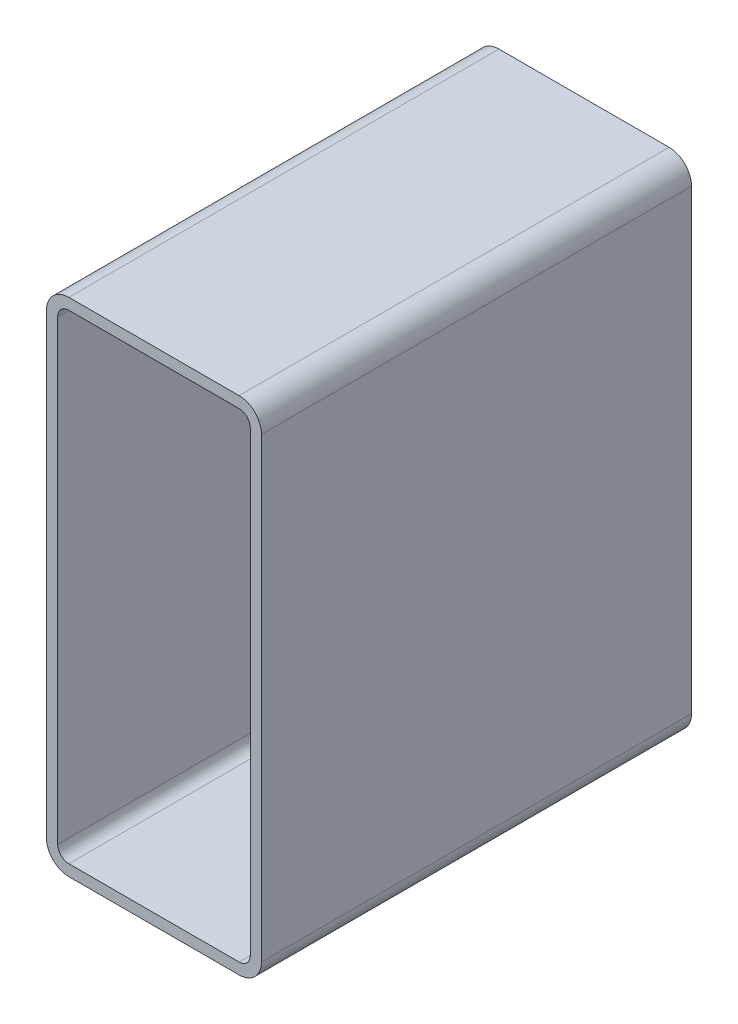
ISO-10303-21;
HEADER;
FILE_DESCRIPTION(('STEP AP214'),'2;1');
FILE_NAME('part.step','',(''),(''),'','','');
FILE_SCHEMA(('AUTOMOTIVE_DESIGN { 1 0 10303 214 1 1 1 1 }'));
ENDSEC;
DATA;
#1=APPLICATION_CONTEXT('core data for automotive mechanical design processes');
#2=APPLICATION_PROTOCOL_DEFINITION('international standard','automotive_design',2000,#1);
#3=PRODUCT_CONTEXT('',#1,'mechanical');
#4=PRODUCT('Part','Part','',(#3));
#5=PRODUCT_RELATED_PRODUCT_CATEGORY('part','',(#4));
#6=PRODUCT_DEFINITION_FORMATION('','',#4);
#7=PRODUCT_DEFINITION_CONTEXT('part definition',#1,'design');
#8=PRODUCT_DEFINITION('design','',#6,#7);
#9=PRODUCT_DEFINITION_SHAPE('','',#8);
#10=(LENGTH_UNIT() NAMED_UNIT(*) SI_UNIT(.MILLI.,.METRE.));
#11=(NAMED_UNIT(*) PLANE_ANGLE_UNIT() SI_UNIT($,.RADIAN.));
#12=(NAMED_UNIT(*) SI_UNIT($,.STERADIAN.) SOLID_ANGLE_UNIT());
#13=UNCERTAINTY_MEASURE_WITH_UNIT(LENGTH_MEASURE(1.E-05),#10,'distance_accuracy_value','');
#14=(GEOMETRIC_REPRESENTATION_CONTEXT(3) GLOBAL_UNCERTAINTY_ASSIGNED_CONTEXT((#13)) GLOBAL_UNIT_ASSIGNED_CONTEXT((#10,
#11,#12)) REPRESENTATION_CONTEXT('',''));
#15=CARTESIAN_POINT('',(0.,0.,0.));
#16=DIRECTION('',(0.,0.,1.));
#17=DIRECTION('',(1.,0.,0.));
#18=AXIS2_PLACEMENT_3D('',#15,#16,#17);
#19=CARTESIAN_POINT('',(15.9223013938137,341.553679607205,304.8));
#20=DIRECTION('',(0.,0.,1.));
#21=DIRECTION('',(1.,0.,0.));
#22=AXIS2_PLACEMENT_3D('',#19,#20,#21);
#23=PLANE('',#22);
#24=CARTESIAN_POINT('',(15.9223013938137,341.553679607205,304.8));
#25=DIRECTION('',(0.,0.,1.));
#26=DIRECTION('',(1.,0.,0.));
#27=AXIS2_PLACEMENT_3D('',#24,#25,#26);
#28=CIRCLE('',#27,15.875);
#29=CARTESIAN_POINT('',(15.9223013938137,357.428679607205,304.8));
#30=VERTEX_POINT('',#29);
#31=CARTESIAN_POINT('',(0.0473013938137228,341.553679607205,304.8));
#32=VERTEX_POINT('',#31);
#33=EDGE_CURVE('E211',#30,#32,#28,.T.);
#34=ORIENTED_EDGE('',*,*,#33,.T.);
#35=DIRECTION('',(0.,-1.,0.));
#36=VECTOR('',#35,1.);
#37=CARTESIAN_POINT('',(0.0473013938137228,17.7036796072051,304.8));
#38=LINE('',#37,#36);
#39=CARTESIAN_POINT('',(0.0473013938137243,17.7036796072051,304.8));
#40=VERTEX_POINT('',#39);
#41=EDGE_CURVE('E214',#32,#40,#38,.T.);
#42=ORIENTED_EDGE('',*,*,#41,.T.);
#43=CARTESIAN_POINT('',(15.9223013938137,17.7036796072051,304.8));
#44=DIRECTION('',(0.,0.,1.));
#45=DIRECTION('',(1.,0.,0.));
#46=AXIS2_PLACEMENT_3D('',#43,#44,#45);
#47=CIRCLE('',#46,15.875);
#48=CARTESIAN_POINT('',(15.9223013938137,1.82867960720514,304.8));
#49=VERTEX_POINT('',#48);
#50=EDGE_CURVE('E217',#40,#49,#47,.T.);
#51=ORIENTED_EDGE('',*,*,#50,.T.);
#52=DIRECTION('',(1.,0.,0.));
#53=VECTOR('',#52,1.);
#54=CARTESIAN_POINT('',(136.572301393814,1.82867960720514,304.8));
#55=LINE('',#54,#53);
#56=CARTESIAN_POINT('',(136.572301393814,1.82867960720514,304.8));
#57=VERTEX_POINT('',#56);
#58=EDGE_CURVE('E219',#49,#57,#55,.T.);
#59=ORIENTED_EDGE('',*,*,#58,.T.);
#60=CARTESIAN_POINT('',(136.572301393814,17.7036796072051,304.8));
#61=DIRECTION('',(0.,0.,1.));
#62=DIRECTION('',(1.,0.,0.));
#63=AXIS2_PLACEMENT_3D('',#60,#61,#62);
#64=CIRCLE('',#63,15.875);
#65=CARTESIAN_POINT('',(152.447301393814,17.7036796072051,304.8));
#66=VERTEX_POINT('',#65);
#67=EDGE_CURVE('E221',#57,#66,#64,.T.);
#68=ORIENTED_EDGE('',*,*,#67,.T.);
#69=DIRECTION('',(0.,1.,0.));
#70=VECTOR('',#69,1.);
#71=CARTESIAN_POINT('',(152.447301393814,341.553679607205,304.8));
#72=LINE('',#71,#70);
#73=CARTESIAN_POINT('',(152.447301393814,341.553679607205,304.8));
#74=VERTEX_POINT('',#73);
#75=EDGE_CURVE('E223',#66,#74,#72,.T.);
#76=ORIENTED_EDGE('',*,*,#75,.T.);
#77=CARTESIAN_POINT('',(136.572301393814,341.553679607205,304.8));
#78=DIRECTION('',(0.,0.,1.));
#79=DIRECTION('',(1.,0.,0.));
#80=AXIS2_PLACEMENT_3D('',#77,#78,#79);
#81=CIRCLE('',#80,15.8749999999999);
#82=CARTESIAN_POINT('',(136.572301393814,357.428679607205,304.8));
#83=VERTEX_POINT('',#82);
#84=EDGE_CURVE('E225',#74,#83,#81,.T.);
#85=ORIENTED_EDGE('',*,*,#84,.T.);
#86=DIRECTION('',(-1.,0.,0.));
#87=VECTOR('',#86,1.);
#88=CARTESIAN_POINT('',(15.9223013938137,357.428679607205,304.8));
#89=LINE('',#88,#87);
#90=EDGE_CURVE('E227',#83,#30,#89,.T.);
#91=ORIENTED_EDGE('',*,*,#90,.T.);
#92=EDGE_LOOP('',(#34,#42,#51,#59,#68,#76,#85,#91));
#93=FACE_BOUND('',#92,.T.);
#94=DIRECTION('',(0.,-1.,0.));
#95=VECTOR('',#94,1.);
#96=CARTESIAN_POINT('',(7.98480139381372,17.7036796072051,304.8));
#97=LINE('',#96,#95);
#98=CARTESIAN_POINT('',(7.98480139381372,341.553679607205,304.8));
#99=VERTEX_POINT('',#98);
#100=CARTESIAN_POINT('',(7.98480139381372,17.7036796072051,304.8));
#101=VERTEX_POINT('',#100);
#102=EDGE_CURVE('E154',#99,#101,#97,.T.);
#103=ORIENTED_EDGE('',*,*,#102,.F.);
#104=CARTESIAN_POINT('',(15.9223013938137,341.553679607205,304.8));
#105=DIRECTION('',(0.,0.,1.));
#106=DIRECTION('',(1.,0.,0.));
#107=AXIS2_PLACEMENT_3D('',#104,#105,#106);
#108=CIRCLE('',#107,7.93749999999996);
#109=CARTESIAN_POINT('',(15.9223013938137,349.491179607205,304.8));
#110=VERTEX_POINT('',#109);
#111=EDGE_CURVE('E146',#110,#99,#108,.T.);
#112=ORIENTED_EDGE('',*,*,#111,.F.);
#113=DIRECTION('',(-1.,0.,0.));
#114=VECTOR('',#113,1.);
#115=CARTESIAN_POINT('',(15.9223013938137,349.491179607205,304.8));
#116=LINE('',#115,#114);
#117=CARTESIAN_POINT('',(136.572301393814,349.491179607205,304.8));
#118=VERTEX_POINT('',#117);
#119=EDGE_CURVE('E179',#118,#110,#116,.T.);
#120=ORIENTED_EDGE('',*,*,#119,.F.);
#121=CARTESIAN_POINT('',(136.572301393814,341.553679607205,304.8));
#122=DIRECTION('',(0.,0.,1.));
#123=DIRECTION('',(1.,0.,0.));
#124=AXIS2_PLACEMENT_3D('',#121,#122,#123);
#125=CIRCLE('',#124,7.93749999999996);
#126=CARTESIAN_POINT('',(144.509801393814,341.553679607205,304.8));
#127=VERTEX_POINT('',#126);
#128=EDGE_CURVE('E177',#127,#118,#125,.T.);
#129=ORIENTED_EDGE('',*,*,#128,.F.);
#130=DIRECTION('',(0.,1.,0.));
#131=VECTOR('',#130,1.);
#132=CARTESIAN_POINT('',(144.509801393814,341.553679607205,304.8));
#133=LINE('',#132,#131);
#134=CARTESIAN_POINT('',(144.509801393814,17.7036796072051,304.8));
#135=VERTEX_POINT('',#134);
#136=EDGE_CURVE('E175',#135,#127,#133,.T.);
#137=ORIENTED_EDGE('',*,*,#136,.F.);
#138=CARTESIAN_POINT('',(136.572301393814,17.7036796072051,304.8));
#139=DIRECTION('',(0.,0.,1.));
#140=DIRECTION('',(1.,0.,0.));
#141=AXIS2_PLACEMENT_3D('',#138,#139,#140);
#142=CIRCLE('',#141,7.93750000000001);
#143=CARTESIAN_POINT('',(136.572301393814,9.76617960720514,304.8));
#144=VERTEX_POINT('',#143);
#145=EDGE_CURVE('E173',#144,#135,#142,.T.);
#146=ORIENTED_EDGE('',*,*,#145,.F.);
#147=DIRECTION('',(1.,0.,0.));
#148=VECTOR('',#147,1.);
#149=CARTESIAN_POINT('',(136.572301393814,9.76617960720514,304.8));
#150=LINE('',#149,#148);
#151=CARTESIAN_POINT('',(15.9223013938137,9.76617960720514,304.8));
#152=VERTEX_POINT('',#151);
#153=EDGE_CURVE('E169',#152,#144,#150,.T.);
#154=ORIENTED_EDGE('',*,*,#153,.F.);
#155=CARTESIAN_POINT('',(15.9223013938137,17.7036796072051,304.8));
#156=DIRECTION('',(0.,0.,1.));
#157=DIRECTION('',(1.,0.,0.));
#158=AXIS2_PLACEMENT_3D('',#155,#156,#157);
#159=CIRCLE('',#158,7.9375);
#160=EDGE_CURVE('E167',#101,#152,#159,.T.);
#161=ORIENTED_EDGE('',*,*,#160,.F.);
#162=EDGE_LOOP('',(#103,#112,#120,#129,#137,#146,#154,#161));
#163=FACE_BOUND('',#162,.T.);
#164=ADVANCED_FACE('F33',(#93,#163),#23,.T.);
#165=CARTESIAN_POINT('',(15.9223013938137,341.553679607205,0.));
#166=DIRECTION('',(0.,0.,1.));
#167=DIRECTION('',(1.,0.,0.));
#168=AXIS2_PLACEMENT_3D('',#165,#166,#167);
#169=PLANE('',#168);
#170=CARTESIAN_POINT('',(15.9223013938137,341.553679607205,0.));
#171=DIRECTION('',(0.,0.,1.));
#172=DIRECTION('',(1.,0.,0.));
#173=AXIS2_PLACEMENT_3D('',#170,#171,#172);
#174=CIRCLE('',#173,15.875);
#175=CARTESIAN_POINT('',(15.9223013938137,357.428679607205,0.));
#176=VERTEX_POINT('',#175);
#177=CARTESIAN_POINT('',(0.0473013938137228,341.553679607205,0.));
#178=VERTEX_POINT('',#177);
#179=EDGE_CURVE('E162',#176,#178,#174,.T.);
#180=ORIENTED_EDGE('',*,*,#179,.F.);
#181=DIRECTION('',(-1.,0.,0.));
#182=VECTOR('',#181,1.);
#183=CARTESIAN_POINT('',(15.9223013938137,357.428679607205,0.));
#184=LINE('',#183,#182);
#185=CARTESIAN_POINT('',(136.572301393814,357.428679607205,0.));
#186=VERTEX_POINT('',#185);
#187=EDGE_CURVE('E215',#186,#176,#184,.T.);
#188=ORIENTED_EDGE('',*,*,#187,.F.);
#189=CARTESIAN_POINT('',(136.572301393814,341.553679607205,0.));
#190=DIRECTION('',(0.,0.,1.));
#191=DIRECTION('',(1.,0.,0.));
#192=AXIS2_PLACEMENT_3D('',#189,#190,#191);
#193=CIRCLE('',#192,15.8749999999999);
#194=CARTESIAN_POINT('',(152.447301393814,341.553679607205,0.));
#195=VERTEX_POINT('',#194);
#196=EDGE_CURVE('E242',#195,#186,#193,.T.);
#197=ORIENTED_EDGE('',*,*,#196,.F.);
#198=DIRECTION('',(0.,1.,0.));
#199=VECTOR('',#198,1.);
#200=CARTESIAN_POINT('',(152.447301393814,341.553679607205,0.));
#201=LINE('',#200,#199);
#202=CARTESIAN_POINT('',(152.447301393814,17.7036796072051,0.));
#203=VERTEX_POINT('',#202);
#204=EDGE_CURVE('E240',#203,#195,#201,.T.);
#205=ORIENTED_EDGE('',*,*,#204,.F.);
#206=CARTESIAN_POINT('',(136.572301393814,17.7036796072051,0.));
#207=DIRECTION('',(0.,0.,1.));
#208=DIRECTION('',(1.,0.,0.));
#209=AXIS2_PLACEMENT_3D('',#206,#207,#208);
#210=CIRCLE('',#209,15.875);
#211=CARTESIAN_POINT('',(136.572301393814,1.82867960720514,0.));
#212=VERTEX_POINT('',#211);
#213=EDGE_CURVE('E238',#212,#203,#210,.T.);
#214=ORIENTED_EDGE('',*,*,#213,.F.);
#215=DIRECTION('',(1.,0.,0.));
#216=VECTOR('',#215,1.);
#217=CARTESIAN_POINT('',(136.572301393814,1.82867960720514,0.));
#218=LINE('',#217,#216);
#219=CARTESIAN_POINT('',(15.9223013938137,1.82867960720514,0.));
#220=VERTEX_POINT('',#219);
#221=EDGE_CURVE('E236',#220,#212,#218,.T.);
#222=ORIENTED_EDGE('',*,*,#221,.F.);
#223=CARTESIAN_POINT('',(15.9223013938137,17.7036796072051,0.));
#224=DIRECTION('',(0.,0.,1.));
#225=DIRECTION('',(1.,0.,0.));
#226=AXIS2_PLACEMENT_3D('',#223,#224,#225);
#227=CIRCLE('',#226,15.875);
#228=CARTESIAN_POINT('',(0.0473013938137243,17.7036796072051,0.));
#229=VERTEX_POINT('',#228);
#230=EDGE_CURVE('E234',#229,#220,#227,.T.);
#231=ORIENTED_EDGE('',*,*,#230,.F.);
#232=DIRECTION('',(0.,-1.,0.));
#233=VECTOR('',#232,1.);
#234=CARTESIAN_POINT('',(0.0473013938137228,17.7036796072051,0.));
#235=LINE('',#234,#233);
#236=EDGE_CURVE('E232',#178,#229,#235,.T.);
#237=ORIENTED_EDGE('',*,*,#236,.F.);
#238=EDGE_LOOP('',(#180,#188,#197,#205,#214,#222,#231,#237));
#239=FACE_BOUND('',#238,.T.);
#240=CARTESIAN_POINT('',(15.9223013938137,341.553679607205,0.));
#241=DIRECTION('',(0.,0.,1.));
#242=DIRECTION('',(1.,0.,0.));
#243=AXIS2_PLACEMENT_3D('',#240,#241,#242);
#244=CIRCLE('',#243,7.93749999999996);
#245=CARTESIAN_POINT('',(15.9223013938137,349.491179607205,0.));
#246=VERTEX_POINT('',#245);
#247=CARTESIAN_POINT('',(7.98480139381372,341.553679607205,0.));
#248=VERTEX_POINT('',#247);
#249=EDGE_CURVE('E56',#246,#248,#244,.T.);
#250=ORIENTED_EDGE('',*,*,#249,.T.);
#251=DIRECTION('',(0.,-1.,0.));
#252=VECTOR('',#251,1.);
#253=CARTESIAN_POINT('',(7.98480139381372,17.7036796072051,0.));
#254=LINE('',#253,#252);
#255=CARTESIAN_POINT('',(7.98480139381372,17.7036796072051,0.));
#256=VERTEX_POINT('',#255);
#257=EDGE_CURVE('E161',#248,#256,#254,.T.);
#258=ORIENTED_EDGE('',*,*,#257,.T.);
#259=CARTESIAN_POINT('',(15.9223013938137,17.7036796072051,0.));
#260=DIRECTION('',(0.,0.,1.));
#261=DIRECTION('',(1.,0.,0.));
#262=AXIS2_PLACEMENT_3D('',#259,#260,#261);
#263=CIRCLE('',#262,7.9375);
#264=CARTESIAN_POINT('',(15.9223013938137,9.76617960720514,0.));
#265=VERTEX_POINT('',#264);
#266=EDGE_CURVE('E183',#256,#265,#263,.T.);
#267=ORIENTED_EDGE('',*,*,#266,.T.);
#268=DIRECTION('',(1.,0.,0.));
#269=VECTOR('',#268,1.);
#270=CARTESIAN_POINT('',(136.572301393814,9.76617960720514,0.));
#271=LINE('',#270,#269);
#272=CARTESIAN_POINT('',(136.572301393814,9.76617960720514,0.));
#273=VERTEX_POINT('',#272);
#274=EDGE_CURVE('E186',#265,#273,#271,.T.);
#275=ORIENTED_EDGE('',*,*,#274,.T.);
#276=CARTESIAN_POINT('',(136.572301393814,17.7036796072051,0.));
#277=DIRECTION('',(0.,0.,1.));
#278=DIRECTION('',(1.,0.,0.));
#279=AXIS2_PLACEMENT_3D('',#276,#277,#278);
#280=CIRCLE('',#279,7.93750000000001);
#281=CARTESIAN_POINT('',(144.509801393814,17.7036796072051,0.));
#282=VERTEX_POINT('',#281);
#283=EDGE_CURVE('E189',#273,#282,#280,.T.);
#284=ORIENTED_EDGE('',*,*,#283,.T.);
#285=DIRECTION('',(0.,1.,0.));
#286=VECTOR('',#285,1.);
#287=CARTESIAN_POINT('',(144.509801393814,341.553679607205,0.));
#288=LINE('',#287,#286);
#289=CARTESIAN_POINT('',(144.509801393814,341.553679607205,0.));
#290=VERTEX_POINT('',#289);
#291=EDGE_CURVE('E192',#282,#290,#288,.T.);
#292=ORIENTED_EDGE('',*,*,#291,.T.);
#293=CARTESIAN_POINT('',(136.572301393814,341.553679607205,0.));
#294=DIRECTION('',(0.,0.,1.));
#295=DIRECTION('',(1.,0.,0.));
#296=AXIS2_PLACEMENT_3D('',#293,#294,#295);
#297=CIRCLE('',#296,7.93749999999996);
#298=CARTESIAN_POINT('',(136.572301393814,349.491179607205,0.));
#299=VERTEX_POINT('',#298);
#300=EDGE_CURVE('E195',#290,#299,#297,.T.);
#301=ORIENTED_EDGE('',*,*,#300,.T.);
#302=DIRECTION('',(-1.,0.,0.));
#303=VECTOR('',#302,1.);
#304=CARTESIAN_POINT('',(15.9223013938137,349.491179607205,0.));
#305=LINE('',#304,#303);
#306=EDGE_CURVE('E155',#299,#246,#305,.T.);
#307=ORIENTED_EDGE('',*,*,#306,.T.);
#308=EDGE_LOOP('',(#250,#258,#267,#275,#284,#292,#301,#307));
#309=FACE_BOUND('',#308,.T.);
#310=ADVANCED_FACE('F272',(#239,#309),#169,.F.);
#311=CARTESIAN_POINT('',(15.9223013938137,341.553679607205,304.8));
#312=DIRECTION('',(0.,0.,-1.));
#313=DIRECTION('',(-1.,0.,0.));
#314=AXIS2_PLACEMENT_3D('',#311,#312,#313);
#315=CYLINDRICAL_SURFACE('',#314,15.875);
#316=ORIENTED_EDGE('',*,*,#179,.T.);
#317=DIRECTION('',(0.,0.,-1.));
#318=VECTOR('',#317,1.);
#319=CARTESIAN_POINT('',(0.0473013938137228,341.553679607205,304.8));
#320=LINE('',#319,#318);
#321=EDGE_CURVE('E11',#32,#178,#320,.T.);
#322=ORIENTED_EDGE('',*,*,#321,.F.);
#323=ORIENTED_EDGE('',*,*,#33,.F.);
#324=DIRECTION('',(0.,0.,-1.));
#325=VECTOR('',#324,1.);
#326=CARTESIAN_POINT('',(15.9223013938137,357.428679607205,304.8));
#327=LINE('',#326,#325);
#328=EDGE_CURVE('E229',#30,#176,#327,.T.);
#329=ORIENTED_EDGE('',*,*,#328,.T.);
#330=EDGE_LOOP('',(#316,#322,#323,#329));
#331=FACE_BOUND('',#330,.T.);
#332=ADVANCED_FACE('F35',(#331),#315,.T.);
#333=CARTESIAN_POINT('',(0.0473013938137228,17.7036796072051,304.8));
#334=DIRECTION('',(1.,0.,0.));
#335=DIRECTION('',(0.,0.,-1.));
#336=AXIS2_PLACEMENT_3D('',#333,#334,#335);
#337=PLANE('',#336);
#338=ORIENTED_EDGE('',*,*,#236,.T.);
#339=DIRECTION('',(0.,0.,-1.));
#340=VECTOR('',#339,1.);
#341=CARTESIAN_POINT('',(0.0473013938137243,17.7036796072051,304.8));
#342=LINE('',#341,#340);
#343=EDGE_CURVE('E41',#40,#229,#342,.T.);
#344=ORIENTED_EDGE('',*,*,#343,.F.);
#345=ORIENTED_EDGE('',*,*,#41,.F.);
#346=ORIENTED_EDGE('',*,*,#321,.T.);
#347=EDGE_LOOP('',(#338,#344,#345,#346));
#348=FACE_BOUND('',#347,.T.);
#349=ADVANCED_FACE('F289',(#348),#337,.F.);
#350=CARTESIAN_POINT('',(15.9223013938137,17.7036796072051,304.8));
#351=DIRECTION('',(0.,0.,-1.));
#352=DIRECTION('',(-1.,0.,0.));
#353=AXIS2_PLACEMENT_3D('',#350,#351,#352);
#354=CYLINDRICAL_SURFACE('',#353,15.875);
#355=ORIENTED_EDGE('',*,*,#230,.T.);
#356=DIRECTION('',(0.,0.,-1.));
#357=VECTOR('',#356,1.);
#358=CARTESIAN_POINT('',(15.9223013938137,1.82867960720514,304.8));
#359=LINE('',#358,#357);
#360=EDGE_CURVE('E259',#49,#220,#359,.T.);
#361=ORIENTED_EDGE('',*,*,#360,.F.);
#362=ORIENTED_EDGE('',*,*,#50,.F.);
#363=ORIENTED_EDGE('',*,*,#343,.T.);
#364=EDGE_LOOP('',(#355,#361,#362,#363));
#365=FACE_BOUND('',#364,.T.);
#366=ADVANCED_FACE('F266',(#365),#354,.T.);
#367=CARTESIAN_POINT('',(136.572301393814,1.82867960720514,304.8));
#368=DIRECTION('',(0.,1.,0.));
#369=DIRECTION('',(0.,0.,1.));
#370=AXIS2_PLACEMENT_3D('',#367,#368,#369);
#371=PLANE('',#370);
#372=ORIENTED_EDGE('',*,*,#221,.T.);
#373=DIRECTION('',(0.,0.,-1.));
#374=VECTOR('',#373,1.);
#375=CARTESIAN_POINT('',(136.572301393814,1.82867960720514,304.8));
#376=LINE('',#375,#374);
#377=EDGE_CURVE('E256',#57,#212,#376,.T.);
#378=ORIENTED_EDGE('',*,*,#377,.F.);
#379=ORIENTED_EDGE('',*,*,#58,.F.);
#380=ORIENTED_EDGE('',*,*,#360,.T.);
#381=EDGE_LOOP('',(#372,#378,#379,#380));
#382=FACE_BOUND('',#381,.T.);
#383=ADVANCED_FACE('F278',(#382),#371,.F.);
#384=CARTESIAN_POINT('',(136.572301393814,17.7036796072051,304.8));
#385=DIRECTION('',(0.,0.,-1.));
#386=DIRECTION('',(-1.,0.,0.));
#387=AXIS2_PLACEMENT_3D('',#384,#385,#386);
#388=CYLINDRICAL_SURFACE('',#387,15.875);
#389=ORIENTED_EDGE('',*,*,#213,.T.);
#390=DIRECTION('',(0.,0.,-1.));
#391=VECTOR('',#390,1.);
#392=CARTESIAN_POINT('',(152.447301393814,17.7036796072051,304.8));
#393=LINE('',#392,#391);
#394=EDGE_CURVE('E253',#66,#203,#393,.T.);
#395=ORIENTED_EDGE('',*,*,#394,.F.);
#396=ORIENTED_EDGE('',*,*,#67,.F.);
#397=ORIENTED_EDGE('',*,*,#377,.T.);
#398=EDGE_LOOP('',(#389,#395,#396,#397));
#399=FACE_BOUND('',#398,.T.);
#400=ADVANCED_FACE('F282',(#399),#388,.T.);
#401=CARTESIAN_POINT('',(152.447301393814,341.553679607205,304.8));
#402=DIRECTION('',(-1.,0.,0.));
#403=DIRECTION('',(0.,0.,1.));
#404=AXIS2_PLACEMENT_3D('',#401,#402,#403);
#405=PLANE('',#404);
#406=ORIENTED_EDGE('',*,*,#204,.T.);
#407=DIRECTION('',(0.,0.,-1.));
#408=VECTOR('',#407,1.);
#409=CARTESIAN_POINT('',(152.447301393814,341.553679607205,304.8));
#410=LINE('',#409,#408);
#411=EDGE_CURVE('E250',#74,#195,#410,.T.);
#412=ORIENTED_EDGE('',*,*,#411,.F.);
#413=ORIENTED_EDGE('',*,*,#75,.F.);
#414=ORIENTED_EDGE('',*,*,#394,.T.);
#415=EDGE_LOOP('',(#406,#412,#413,#414));
#416=FACE_BOUND('',#415,.T.);
#417=ADVANCED_FACE('F302',(#416),#405,.F.);
#418=CARTESIAN_POINT('',(136.572301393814,341.553679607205,304.8));
#419=DIRECTION('',(0.,0.,-1.));
#420=DIRECTION('',(-1.,0.,0.));
#421=AXIS2_PLACEMENT_3D('',#418,#419,#420);
#422=CYLINDRICAL_SURFACE('',#421,15.8749999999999);
#423=ORIENTED_EDGE('',*,*,#196,.T.);
#424=DIRECTION('',(0.,0.,-1.));
#425=VECTOR('',#424,1.);
#426=CARTESIAN_POINT('',(136.572301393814,357.428679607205,304.8));
#427=LINE('',#426,#425);
#428=EDGE_CURVE('E247',#83,#186,#427,.T.);
#429=ORIENTED_EDGE('',*,*,#428,.F.);
#430=ORIENTED_EDGE('',*,*,#84,.F.);
#431=ORIENTED_EDGE('',*,*,#411,.T.);
#432=EDGE_LOOP('',(#423,#429,#430,#431));
#433=FACE_BOUND('',#432,.T.);
#434=ADVANCED_FACE('F300',(#433),#422,.T.);
#435=CARTESIAN_POINT('',(15.9223013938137,357.428679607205,304.8));
#436=DIRECTION('',(0.,-1.,0.));
#437=DIRECTION('',(0.,0.,-1.));
#438=AXIS2_PLACEMENT_3D('',#435,#436,#437);
#439=PLANE('',#438);
#440=ORIENTED_EDGE('',*,*,#187,.T.);
#441=ORIENTED_EDGE('',*,*,#328,.F.);
#442=ORIENTED_EDGE('',*,*,#90,.F.);
#443=ORIENTED_EDGE('',*,*,#428,.T.);
#444=EDGE_LOOP('',(#440,#441,#442,#443));
#445=FACE_BOUND('',#444,.T.);
#446=ADVANCED_FACE('F295',(#445),#439,.F.);
#447=CARTESIAN_POINT('',(15.9223013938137,341.553679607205,304.8));
#448=DIRECTION('',(0.,0.,-1.));
#449=DIRECTION('',(-1.,0.,0.));
#450=AXIS2_PLACEMENT_3D('',#447,#448,#449);
#451=CYLINDRICAL_SURFACE('',#450,7.93749999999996);
#452=ORIENTED_EDGE('',*,*,#249,.F.);
#453=DIRECTION('',(0.,0.,-1.));
#454=VECTOR('',#453,1.);
#455=CARTESIAN_POINT('',(15.9223013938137,349.491179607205,304.8));
#456=LINE('',#455,#454);
#457=EDGE_CURVE('E150',#110,#246,#456,.T.);
#458=ORIENTED_EDGE('',*,*,#457,.F.);
#459=ORIENTED_EDGE('',*,*,#111,.T.);
#460=DIRECTION('',(0.,0.,-1.));
#461=VECTOR('',#460,1.);
#462=CARTESIAN_POINT('',(7.98480139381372,341.553679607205,304.8));
#463=LINE('',#462,#461);
#464=EDGE_CURVE('E149',#99,#248,#463,.T.);
#465=ORIENTED_EDGE('',*,*,#464,.T.);
#466=EDGE_LOOP('',(#452,#458,#459,#465));
#467=FACE_BOUND('',#466,.T.);
#468=ADVANCED_FACE('F148',(#467),#451,.F.);
#469=CARTESIAN_POINT('',(7.98480139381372,17.7036796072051,304.8));
#470=DIRECTION('',(1.,0.,0.));
#471=DIRECTION('',(0.,0.,-1.));
#472=AXIS2_PLACEMENT_3D('',#469,#470,#471);
#473=PLANE('',#472);
#474=ORIENTED_EDGE('',*,*,#257,.F.);
#475=ORIENTED_EDGE('',*,*,#464,.F.);
#476=ORIENTED_EDGE('',*,*,#102,.T.);
#477=DIRECTION('',(0.,0.,-1.));
#478=VECTOR('',#477,1.);
#479=CARTESIAN_POINT('',(7.98480139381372,17.7036796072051,304.8));
#480=LINE('',#479,#478);
#481=EDGE_CURVE('E163',#101,#256,#480,.T.);
#482=ORIENTED_EDGE('',*,*,#481,.T.);
#483=EDGE_LOOP('',(#474,#475,#476,#482));
#484=FACE_BOUND('',#483,.T.);
#485=ADVANCED_FACE('F158',(#484),#473,.T.);
#486=CARTESIAN_POINT('',(15.9223013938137,17.7036796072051,304.8));
#487=DIRECTION('',(0.,0.,-1.));
#488=DIRECTION('',(-1.,0.,0.));
#489=AXIS2_PLACEMENT_3D('',#486,#487,#488);
#490=CYLINDRICAL_SURFACE('',#489,7.9375);
#491=ORIENTED_EDGE('',*,*,#266,.F.);
#492=ORIENTED_EDGE('',*,*,#481,.F.);
#493=ORIENTED_EDGE('',*,*,#160,.T.);
#494=DIRECTION('',(0.,0.,-1.));
#495=VECTOR('',#494,1.);
#496=CARTESIAN_POINT('',(15.9223013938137,9.76617960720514,304.8));
#497=LINE('',#496,#495);
#498=EDGE_CURVE('E208',#152,#265,#497,.T.);
#499=ORIENTED_EDGE('',*,*,#498,.T.);
#500=EDGE_LOOP('',(#491,#492,#493,#499));
#501=FACE_BOUND('',#500,.T.);
#502=ADVANCED_FACE('F327',(#501),#490,.F.);
#503=CARTESIAN_POINT('',(136.572301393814,9.76617960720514,304.8));
#504=DIRECTION('',(0.,1.,0.));
#505=DIRECTION('',(0.,0.,1.));
#506=AXIS2_PLACEMENT_3D('',#503,#504,#505);
#507=PLANE('',#506);
#508=ORIENTED_EDGE('',*,*,#274,.F.);
#509=ORIENTED_EDGE('',*,*,#498,.F.);
#510=ORIENTED_EDGE('',*,*,#153,.T.);
#511=DIRECTION('',(0.,0.,-1.));
#512=VECTOR('',#511,1.);
#513=CARTESIAN_POINT('',(136.572301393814,9.76617960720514,304.8));
#514=LINE('',#513,#512);
#515=EDGE_CURVE('E206',#144,#273,#514,.T.);
#516=ORIENTED_EDGE('',*,*,#515,.T.);
#517=EDGE_LOOP('',(#508,#509,#510,#516));
#518=FACE_BOUND('',#517,.T.);
#519=ADVANCED_FACE('F331',(#518),#507,.T.);
#520=CARTESIAN_POINT('',(136.572301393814,17.7036796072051,304.8));
#521=DIRECTION('',(0.,0.,-1.));
#522=DIRECTION('',(-1.,0.,0.));
#523=AXIS2_PLACEMENT_3D('',#520,#521,#522);
#524=CYLINDRICAL_SURFACE('',#523,7.93750000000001);
#525=ORIENTED_EDGE('',*,*,#283,.F.);
#526=ORIENTED_EDGE('',*,*,#515,.F.);
#527=ORIENTED_EDGE('',*,*,#145,.T.);
#528=DIRECTION('',(0.,0.,-1.));
#529=VECTOR('',#528,1.);
#530=CARTESIAN_POINT('',(144.509801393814,17.7036796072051,304.8));
#531=LINE('',#530,#529);
#532=EDGE_CURVE('E204',#135,#282,#531,.T.);
#533=ORIENTED_EDGE('',*,*,#532,.T.);
#534=EDGE_LOOP('',(#525,#526,#527,#533));
#535=FACE_BOUND('',#534,.T.);
#536=ADVANCED_FACE('F337',(#535),#524,.F.);
#537=CARTESIAN_POINT('',(144.509801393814,341.553679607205,304.8));
#538=DIRECTION('',(-1.,0.,0.));
#539=DIRECTION('',(0.,0.,1.));
#540=AXIS2_PLACEMENT_3D('',#537,#538,#539);
#541=PLANE('',#540);
#542=ORIENTED_EDGE('',*,*,#291,.F.);
#543=ORIENTED_EDGE('',*,*,#532,.F.);
#544=ORIENTED_EDGE('',*,*,#136,.T.);
#545=DIRECTION('',(0.,0.,-1.));
#546=VECTOR('',#545,1.);
#547=CARTESIAN_POINT('',(144.509801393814,341.553679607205,304.8));
#548=LINE('',#547,#546);
#549=EDGE_CURVE('E202',#127,#290,#548,.T.);
#550=ORIENTED_EDGE('',*,*,#549,.T.);
#551=EDGE_LOOP('',(#542,#543,#544,#550));
#552=FACE_BOUND('',#551,.T.);
#553=ADVANCED_FACE('F341',(#552),#541,.T.);
#554=CARTESIAN_POINT('',(136.572301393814,341.553679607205,304.8));
#555=DIRECTION('',(0.,0.,-1.));
#556=DIRECTION('',(-1.,0.,0.));
#557=AXIS2_PLACEMENT_3D('',#554,#555,#556);
#558=CYLINDRICAL_SURFACE('',#557,7.93749999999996);
#559=ORIENTED_EDGE('',*,*,#300,.F.);
#560=ORIENTED_EDGE('',*,*,#549,.F.);
#561=ORIENTED_EDGE('',*,*,#128,.T.);
#562=DIRECTION('',(0.,0.,-1.));
#563=VECTOR('',#562,1.);
#564=CARTESIAN_POINT('',(136.572301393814,349.491179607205,304.8));
#565=LINE('',#564,#563);
#566=EDGE_CURVE('E48',#118,#299,#565,.T.);
#567=ORIENTED_EDGE('',*,*,#566,.T.);
#568=EDGE_LOOP('',(#559,#560,#561,#567));
#569=FACE_BOUND('',#568,.T.);
#570=ADVANCED_FACE('F345',(#569),#558,.F.);
#571=CARTESIAN_POINT('',(15.9223013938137,349.491179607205,304.8));
#572=DIRECTION('',(0.,-1.,0.));
#573=DIRECTION('',(0.,0.,-1.));
#574=AXIS2_PLACEMENT_3D('',#571,#572,#573);
#575=PLANE('',#574);
#576=ORIENTED_EDGE('',*,*,#306,.F.);
#577=ORIENTED_EDGE('',*,*,#566,.F.);
#578=ORIENTED_EDGE('',*,*,#119,.T.);
#579=ORIENTED_EDGE('',*,*,#457,.T.);
#580=EDGE_LOOP('',(#576,#577,#578,#579));
#581=FACE_BOUND('',#580,.T.);
#582=ADVANCED_FACE('F349',(#581),#575,.T.);
#583=CLOSED_SHELL('',(#164,#310,#332,#349,#366,#383,#400,#417,#434,#446,#468,#485,#502,#519,
#536,#553,#570,#582));
#584=MANIFOLD_SOLID_BREP('B2',#583);
#585=ADVANCED_BREP_SHAPE_REPRESENTATION('',(#18,#584),#14);
#586=SHAPE_DEFINITION_REPRESENTATION(#9,#585);
ENDSEC;
END-ISO-10303-21;
